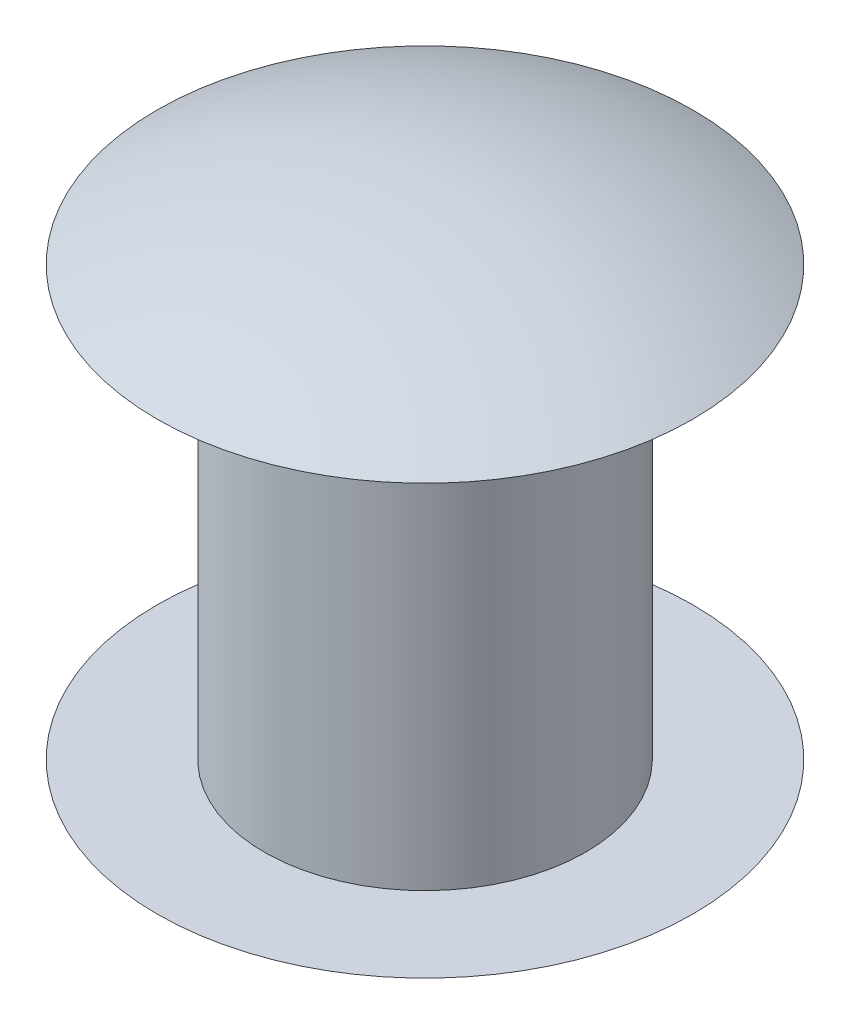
from build123d import *


with BuildPart() as part:
    # Sketch 1 → Revolve 1 (revolve)
    with BuildSketch(Plane.XY):
        with BuildLine():
            Line((0, 2.6), (0, -2.6))
            ThreePointArc((0, -2.6), (1.285496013, -2.447900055), (2.5, -2))
            Line((2.5, -2), (1.5, -2))
            Line((1.5, -2), (1.5, 2))
            Line((1.5, 2), (2.5, 2))
            ThreePointArc((2.5, 2), (1.285496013, 2.447900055), (0, 2.6))
        make_face()
    revolve(axis=Axis((0, 0, 0), (0, 1, 0)))


solid = part.part
